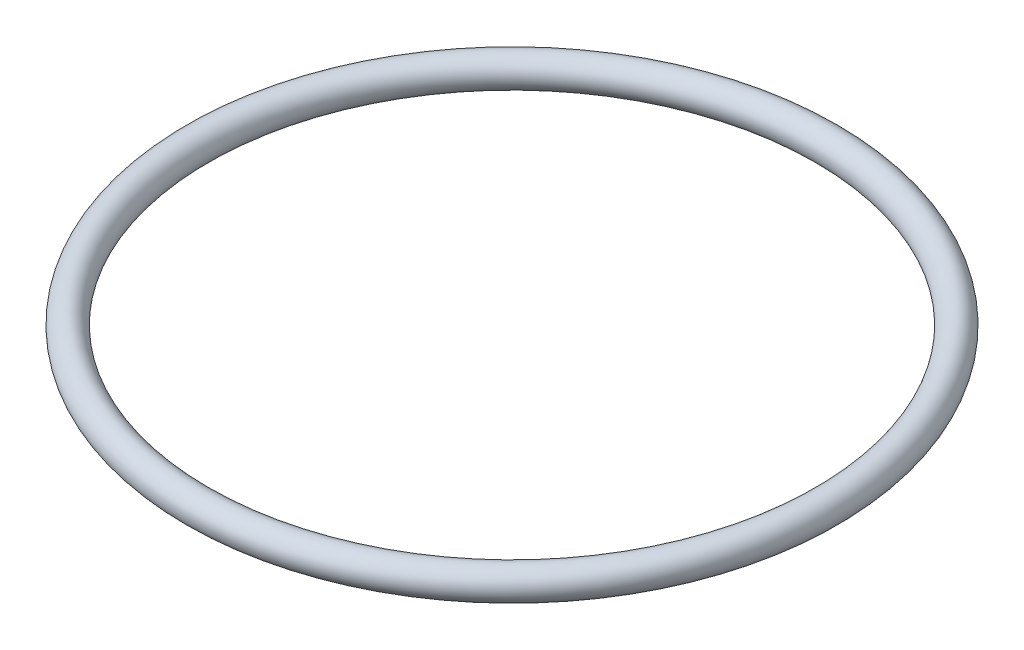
from build123d import *

# Parameters (mm, degrees)
SKETCH1_R = 0.889


with BuildPart() as part:
    # Sketch1 → Revolve1 (revolve)
    with BuildSketch(Plane.XY, mode=Mode.PRIVATE) as revolve1_sk:
        with Locations((18.2118, 0)):
            Circle(SKETCH1_R)
    revolve(revolve1_sk.sketch.rotate(Axis((0, 3.724897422, 0), (0, -1, 0)), 90), axis=Axis((0, 3.724897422, 0), (0, -1, 0)))


solid = part.part
